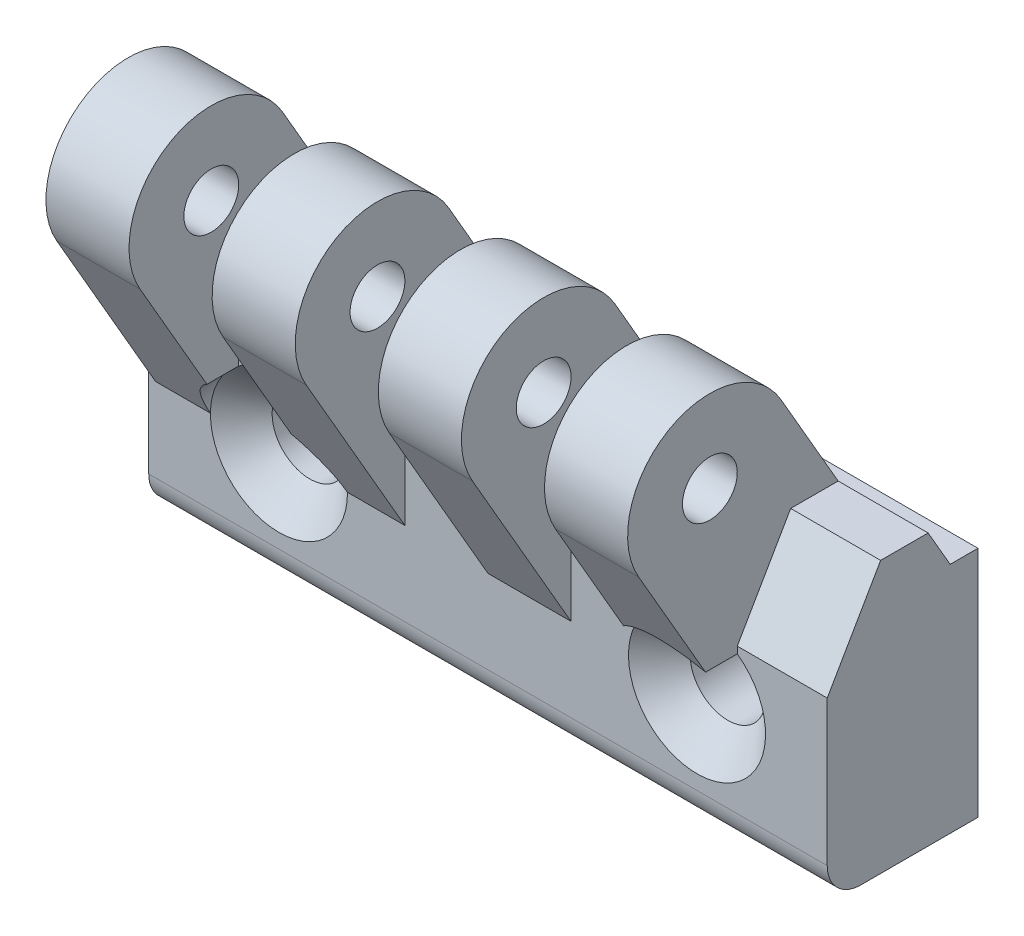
ISO-10303-21;
HEADER;
FILE_DESCRIPTION(('STEP AP214'),'2;1');
FILE_NAME('part.step','',(''),(''),'','','');
FILE_SCHEMA(('AUTOMOTIVE_DESIGN { 1 0 10303 214 1 1 1 1 }'));
ENDSEC;
DATA;
#1=APPLICATION_CONTEXT('core data for automotive mechanical design processes');
#2=APPLICATION_PROTOCOL_DEFINITION('international standard','automotive_design',2000,#1);
#3=PRODUCT_CONTEXT('',#1,'mechanical');
#4=PRODUCT('Part','Part','',(#3));
#5=PRODUCT_RELATED_PRODUCT_CATEGORY('part','',(#4));
#6=PRODUCT_DEFINITION_FORMATION('','',#4);
#7=PRODUCT_DEFINITION_CONTEXT('part definition',#1,'design');
#8=PRODUCT_DEFINITION('design','',#6,#7);
#9=PRODUCT_DEFINITION_SHAPE('','',#8);
#10=(LENGTH_UNIT() NAMED_UNIT(*) SI_UNIT(.MILLI.,.METRE.));
#11=(NAMED_UNIT(*) PLANE_ANGLE_UNIT() SI_UNIT($,.RADIAN.));
#12=(NAMED_UNIT(*) SI_UNIT($,.STERADIAN.) SOLID_ANGLE_UNIT());
#13=UNCERTAINTY_MEASURE_WITH_UNIT(LENGTH_MEASURE(1.E-05),#10,'distance_accuracy_value','');
#14=(GEOMETRIC_REPRESENTATION_CONTEXT(3) GLOBAL_UNCERTAINTY_ASSIGNED_CONTEXT((#13)) GLOBAL_UNIT_ASSIGNED_CONTEXT((#10,
#11,#12)) REPRESENTATION_CONTEXT('',''));
#15=CARTESIAN_POINT('',(0.,0.,0.));
#16=DIRECTION('',(0.,0.,1.));
#17=DIRECTION('',(1.,0.,0.));
#18=AXIS2_PLACEMENT_3D('',#15,#16,#17);
#19=CARTESIAN_POINT('',(40.,8.5000000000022,4.49293380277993E-13));
#20=DIRECTION('',(0.,0.,-1.));
#21=DIRECTION('',(0.,-1.,0.));
#22=AXIS2_PLACEMENT_3D('',#19,#20,#21);
#23=PLANE('',#22);
#24=CARTESIAN_POINT('',(30.5,0.,-2.2291196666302E-12));
#25=DIRECTION('',(0.,0.,1.));
#26=DIRECTION('',(-1.,0.,0.));
#27=AXIS2_PLACEMENT_3D('',#24,#25,#26);
#28=CIRCLE('',#27,2.75);
#29=CARTESIAN_POINT('',(27.75,0.,-2.2291196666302E-12));
#30=VERTEX_POINT('',#29);
#31=EDGE_CURVE('E702',#30,#30,#28,.T.);
#32=ORIENTED_EDGE('',*,*,#31,.T.);
#33=EDGE_LOOP('',(#32));
#34=FACE_BOUND('',#33,.T.);
#35=DIRECTION('',(0.,-1.,0.));
#36=VECTOR('',#35,1.);
#37=CARTESIAN_POINT('',(-9.5,8.5000000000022,4.49293380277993E-13));
#38=LINE('',#37,#36);
#39=CARTESIAN_POINT('',(-9.5,8.5000000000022,4.49293380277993E-13));
#40=VERTEX_POINT('',#39);
#41=CARTESIAN_POINT('',(-9.5,-8.4999999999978,-4.5102810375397E-13));
#42=VERTEX_POINT('',#41);
#43=EDGE_CURVE('E353',#40,#42,#38,.T.);
#44=ORIENTED_EDGE('',*,*,#43,.F.);
#45=DIRECTION('',(-1.,0.,0.));
#46=VECTOR('',#45,1.);
#47=CARTESIAN_POINT('',(40.,8.5000000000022,4.49293380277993E-13));
#48=LINE('',#47,#46);
#49=CARTESIAN_POINT('',(40.,8.5000000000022,4.49293380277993E-13));
#50=VERTEX_POINT('',#49);
#51=EDGE_CURVE('E402',#50,#40,#48,.T.);
#52=ORIENTED_EDGE('',*,*,#51,.F.);
#53=DIRECTION('',(0.,-1.,0.));
#54=VECTOR('',#53,1.);
#55=CARTESIAN_POINT('',(40.,8.5000000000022,4.49293380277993E-13));
#56=LINE('',#55,#54);
#57=CARTESIAN_POINT('',(40.,-8.4999999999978,-4.5102810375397E-13));
#58=VERTEX_POINT('',#57);
#59=EDGE_CURVE('E376',#50,#58,#56,.T.);
#60=ORIENTED_EDGE('',*,*,#59,.T.);
#61=DIRECTION('',(-1.,0.,0.));
#62=VECTOR('',#61,1.);
#63=CARTESIAN_POINT('',(40.,-8.4999999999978,-4.5102810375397E-13));
#64=LINE('',#63,#62);
#65=EDGE_CURVE('E400',#58,#42,#64,.T.);
#66=ORIENTED_EDGE('',*,*,#65,.T.);
#67=EDGE_LOOP('',(#44,#52,#60,#66));
#68=FACE_BOUND('',#67,.T.);
#69=CARTESIAN_POINT('',(0.,0.,-2.2291196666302E-12));
#70=DIRECTION('',(0.,0.,1.));
#71=DIRECTION('',(-1.,0.,0.));
#72=AXIS2_PLACEMENT_3D('',#69,#70,#71);
#73=CIRCLE('',#72,2.75);
#74=CARTESIAN_POINT('',(-2.75,0.,-2.2291196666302E-12));
#75=VERTEX_POINT('',#74);
#76=EDGE_CURVE('E1105',#75,#75,#73,.T.);
#77=ORIENTED_EDGE('',*,*,#76,.T.);
#78=EDGE_LOOP('',(#77));
#79=FACE_BOUND('',#78,.T.);
#80=ADVANCED_FACE('F16',(#34,#68,#79),#23,.T.);
#81=CARTESIAN_POINT('',(40.,-6.05555555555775,10.9999999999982));
#82=DIRECTION('',(0.,0.,1.));
#83=DIRECTION('',(0.,1.,0.));
#84=AXIS2_PLACEMENT_3D('',#81,#82,#83);
#85=PLANE('',#84);
#86=CARTESIAN_POINT('',(0.,0.,10.9999999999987));
#87=DIRECTION('',(0.,0.,1.));
#88=DIRECTION('',(-1.,0.,0.));
#89=AXIS2_PLACEMENT_3D('',#86,#87,#88);
#90=CIRCLE('',#89,5.);
#91=CARTESIAN_POINT('',(-2.1045108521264,4.5355301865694,10.9999999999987));
#92=VERTEX_POINT('',#91);
#93=CARTESIAN_POINT('',(-2.9375,4.04612082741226,10.999999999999));
#94=VERTEX_POINT('',#93);
#95=EDGE_CURVE('E259',#92,#94,#90,.T.);
#96=ORIENTED_EDGE('',*,*,#95,.F.);
#97=DIRECTION('',(-1.,0.,0.));
#98=VECTOR('',#97,1.);
#99=CARTESIAN_POINT('',(40.,4.53553018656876,10.9999999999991));
#100=LINE('',#99,#98);
#101=CARTESIAN_POINT('',(-2.9375,4.53553018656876,10.9999999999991));
#102=VERTEX_POINT('',#101);
#103=EDGE_CURVE('E394',#92,#102,#100,.T.);
#104=ORIENTED_EDGE('',*,*,#103,.T.);
#105=DIRECTION('',(0.,-1.,1.03320874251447E-13));
#106=VECTOR('',#105,1.);
#107=CARTESIAN_POINT('',(-2.9375,4.53553018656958,10.9999999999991));
#108=LINE('',#107,#106);
#109=EDGE_CURVE('E330',#102,#94,#108,.T.);
#110=ORIENTED_EDGE('',*,*,#109,.T.);
#111=EDGE_LOOP('',(#96,#104,#110));
#112=FACE_BOUND('',#111,.T.);
#113=ADVANCED_FACE('F539',(#112),#85,.T.);
#114=CARTESIAN_POINT('',(-4.99987112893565,0.0358983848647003,10.9999999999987));
#115=VERTEX_POINT('',#114);
#116=CARTESIAN_POINT('',(4.99987112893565,0.0358983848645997,10.9999999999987));
#117=VERTEX_POINT('',#116);
#118=EDGE_CURVE('E249',#115,#117,#90,.T.);
#119=ORIENTED_EDGE('',*,*,#118,.F.);
#120=DIRECTION('',(-1.,0.,0.));
#121=VECTOR('',#120,1.);
#122=CARTESIAN_POINT('',(-2.9375,0.0358983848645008,10.9999999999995));
#123=LINE('',#122,#121);
#124=CARTESIAN_POINT('',(-9.,0.0358983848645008,10.9999999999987));
#125=VERTEX_POINT('',#124);
#126=EDGE_CURVE('E339',#115,#125,#123,.T.);
#127=ORIENTED_EDGE('',*,*,#126,.T.);
#128=DIRECTION('',(0.,-1.,1.03320874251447E-13));
#129=VECTOR('',#128,1.);
#130=CARTESIAN_POINT('',(-9.,4.53553018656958,10.9999999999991));
#131=LINE('',#130,#129);
#132=CARTESIAN_POINT('',(-9.,4.53553018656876,10.9999999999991));
#133=VERTEX_POINT('',#132);
#134=EDGE_CURVE('E312',#133,#125,#131,.T.);
#135=ORIENTED_EDGE('',*,*,#134,.F.);
#136=CARTESIAN_POINT('',(-9.5,4.53553018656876,10.9999999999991));
#137=VERTEX_POINT('',#136);
#138=EDGE_CURVE('E395',#133,#137,#100,.T.);
#139=ORIENTED_EDGE('',*,*,#138,.T.);
#140=DIRECTION('',(0.,1.,0.));
#141=VECTOR('',#140,1.);
#142=CARTESIAN_POINT('',(-9.5,-6.05555555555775,10.9999999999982));
#143=LINE('',#142,#141);
#144=CARTESIAN_POINT('',(-9.5,-6.05555555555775,10.9999999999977));
#145=VERTEX_POINT('',#144);
#146=EDGE_CURVE('E362',#145,#137,#143,.T.);
#147=ORIENTED_EDGE('',*,*,#146,.F.);
#148=DIRECTION('',(-1.,0.,0.));
#149=VECTOR('',#148,1.);
#150=CARTESIAN_POINT('',(40.,-6.05555555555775,10.9999999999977));
#151=LINE('',#150,#149);
#152=CARTESIAN_POINT('',(40.,-6.05555555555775,10.9999999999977));
#153=VERTEX_POINT('',#152);
#154=EDGE_CURVE('E396',#153,#145,#151,.T.);
#155=ORIENTED_EDGE('',*,*,#154,.F.);
#156=DIRECTION('',(0.,1.,0.));
#157=VECTOR('',#156,1.);
#158=CARTESIAN_POINT('',(40.,-6.05555555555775,10.9999999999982));
#159=LINE('',#158,#157);
#160=CARTESIAN_POINT('',(40.,4.53553018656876,10.9999999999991));
#161=VERTEX_POINT('',#160);
#162=EDGE_CURVE('E386',#153,#161,#159,.T.);
#163=ORIENTED_EDGE('',*,*,#162,.T.);
#164=CARTESIAN_POINT('',(33.4375,4.53553018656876,10.9999999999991));
#165=VERTEX_POINT('',#164);
#166=EDGE_CURVE('E390',#161,#165,#100,.T.);
#167=ORIENTED_EDGE('',*,*,#166,.T.);
#168=DIRECTION('',(0.,-1.,1.03320874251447E-13));
#169=VECTOR('',#168,1.);
#170=CARTESIAN_POINT('',(33.4375,4.5355301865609,10.9999999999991));
#171=LINE('',#170,#169);
#172=CARTESIAN_POINT('',(33.4375,4.04612082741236,10.999999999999));
#173=VERTEX_POINT('',#172);
#174=EDGE_CURVE('E630',#165,#173,#171,.T.);
#175=ORIENTED_EDGE('',*,*,#174,.T.);
#176=CARTESIAN_POINT('',(30.5,0.,10.9999999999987));
#177=DIRECTION('',(0.,0.,1.));
#178=DIRECTION('',(-1.,0.,0.));
#179=AXIS2_PLACEMENT_3D('',#176,#177,#178);
#180=CIRCLE('',#179,5.);
#181=CARTESIAN_POINT('',(27.3750000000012,3.90312374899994,10.9999999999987));
#182=VERTEX_POINT('',#181);
#183=EDGE_CURVE('E710',#182,#173,#180,.T.);
#184=ORIENTED_EDGE('',*,*,#183,.F.);
#185=DIRECTION('',(0.,-1.,1.03320874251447E-13));
#186=VECTOR('',#185,1.);
#187=CARTESIAN_POINT('',(27.375,4.5355301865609,10.9999999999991));
#188=LINE('',#187,#186);
#189=CARTESIAN_POINT('',(27.375,4.53553018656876,10.9999999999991));
#190=VERTEX_POINT('',#189);
#191=EDGE_CURVE('E31',#190,#182,#188,.T.);
#192=ORIENTED_EDGE('',*,*,#191,.F.);
#193=CARTESIAN_POINT('',(21.3125,4.53553018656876,10.9999999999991));
#194=VERTEX_POINT('',#193);
#195=EDGE_CURVE('E393',#190,#194,#100,.T.);
#196=ORIENTED_EDGE('',*,*,#195,.T.);
#197=DIRECTION('',(0.,-1.,1.03320874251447E-13));
#198=VECTOR('',#197,1.);
#199=CARTESIAN_POINT('',(21.3125,4.53553018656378,10.9999999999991));
#200=LINE('',#199,#198);
#201=CARTESIAN_POINT('',(21.3125,0.0358983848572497,10.9999999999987));
#202=VERTEX_POINT('',#201);
#203=EDGE_CURVE('E490',#194,#202,#200,.T.);
#204=ORIENTED_EDGE('',*,*,#203,.T.);
#205=DIRECTION('',(-1.,0.,0.));
#206=VECTOR('',#205,1.);
#207=CARTESIAN_POINT('',(21.3125,0.0358983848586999,10.9999999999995));
#208=LINE('',#207,#206);
#209=CARTESIAN_POINT('',(15.25,0.0358983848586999,10.9999999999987));
#210=VERTEX_POINT('',#209);
#211=EDGE_CURVE('E515',#202,#210,#208,.T.);
#212=ORIENTED_EDGE('',*,*,#211,.T.);
#213=DIRECTION('',(0.,-1.,1.03320874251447E-13));
#214=VECTOR('',#213,1.);
#215=CARTESIAN_POINT('',(15.25,4.53553018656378,10.9999999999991));
#216=LINE('',#215,#214);
#217=CARTESIAN_POINT('',(15.25,4.53553018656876,10.9999999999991));
#218=VERTEX_POINT('',#217);
#219=EDGE_CURVE('E658',#218,#210,#216,.T.);
#220=ORIENTED_EDGE('',*,*,#219,.F.);
#221=CARTESIAN_POINT('',(9.1875,4.53553018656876,10.9999999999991));
#222=VERTEX_POINT('',#221);
#223=EDGE_CURVE('E486',#218,#222,#100,.T.);
#224=ORIENTED_EDGE('',*,*,#223,.T.);
#225=DIRECTION('',(0.,-1.,1.03320874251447E-13));
#226=VECTOR('',#225,1.);
#227=CARTESIAN_POINT('',(9.1875,4.53553018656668,10.9999999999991));
#228=LINE('',#227,#226);
#229=CARTESIAN_POINT('',(9.1875,0.0358983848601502,10.9999999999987));
#230=VERTEX_POINT('',#229);
#231=EDGE_CURVE('E285',#222,#230,#228,.T.);
#232=ORIENTED_EDGE('',*,*,#231,.T.);
#233=DIRECTION('',(-1.,0.,0.));
#234=VECTOR('',#233,1.);
#235=CARTESIAN_POINT('',(9.1875,0.0358983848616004,10.9999999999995));
#236=LINE('',#235,#234);
#237=EDGE_CURVE('E277',#230,#117,#236,.T.);
#238=ORIENTED_EDGE('',*,*,#237,.T.);
#239=EDGE_LOOP('',(#119,#127,#135,#139,#147,#155,#163,#167,#175,#184,#192,#196,#204,#212,#220,
#224,#232,#238));
#240=FACE_BOUND('',#239,.T.);
#241=ADVANCED_FACE('F283',(#240),#85,.T.);
#242=CARTESIAN_POINT('',(-2.9375,0.0358983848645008,10.9999999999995));
#243=DIRECTION('',(0.,-0.5,0.86602540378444));
#244=DIRECTION('',(0.,0.86602540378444,0.5));
#245=AXIS2_PLACEMENT_3D('',#242,#243,#244);
#246=PLANE('',#245);
#247=ORIENTED_EDGE('',*,*,#126,.F.);
#248=CARTESIAN_POINT('',(0.,2.19962936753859E-12,10.9792740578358));
#249=DIRECTION('',(0.,-0.5,0.86602540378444));
#250=DIRECTION('',(0.,-0.86602540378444,-0.5));
#251=AXIS2_PLACEMENT_3D('',#248,#249,#250);
#252=ELLIPSE('',#251,5.77350269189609,5.0000000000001);
#253=CARTESIAN_POINT('',(-2.9375,4.04612082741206,13.3153030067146));
#254=VERTEX_POINT('',#253);
#255=EDGE_CURVE('E270',#115,#254,#252,.F.);
#256=ORIENTED_EDGE('',*,*,#255,.T.);
#257=DIRECTION('',(0.,0.86602540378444,0.5));
#258=VECTOR('',#257,1.);
#259=CARTESIAN_POINT('',(-2.9375,0.0358983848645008,10.9999999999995));
#260=LINE('',#259,#258);
#261=CARTESIAN_POINT('',(-2.9375,12.5000000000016,18.1961524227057));
#262=VERTEX_POINT('',#261);
#263=EDGE_CURVE('E333',#254,#262,#260,.T.);
#264=ORIENTED_EDGE('',*,*,#263,.T.);
#265=DIRECTION('',(-1.,0.,0.));
#266=VECTOR('',#265,1.);
#267=CARTESIAN_POINT('',(-2.9375,12.5000000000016,18.1961524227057));
#268=LINE('',#267,#266);
#269=CARTESIAN_POINT('',(-9.,12.5000000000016,18.1961524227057));
#270=VERTEX_POINT('',#269);
#271=EDGE_CURVE('E336',#262,#270,#268,.T.);
#272=ORIENTED_EDGE('',*,*,#271,.T.);
#273=DIRECTION('',(0.,0.86602540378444,0.5));
#274=VECTOR('',#273,1.);
#275=CARTESIAN_POINT('',(-9.,0.0358983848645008,10.9999999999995));
#276=LINE('',#275,#274);
#277=EDGE_CURVE('E315',#125,#270,#276,.T.);
#278=ORIENTED_EDGE('',*,*,#277,.F.);
#279=EDGE_LOOP('',(#247,#256,#264,#272,#278));
#280=FACE_BOUND('',#279,.T.);
#281=ADVANCED_FACE('F694',(#280),#246,.T.);
#282=CARTESIAN_POINT('',(-2.9375,15.5000000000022,12.9999999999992));
#283=DIRECTION('',(-1.,0.,0.));
#284=DIRECTION('',(0.,-1.,0.));
#285=AXIS2_PLACEMENT_3D('',#282,#283,#284);
#286=PLANE('',#285);
#287=CARTESIAN_POINT('',(-2.9375,15.5000000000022,12.9999999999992));
#288=DIRECTION('',(-1.,0.,0.));
#289=DIRECTION('',(0.,-1.,0.));
#290=AXIS2_PLACEMENT_3D('',#287,#288,#289);
#291=CIRCLE('',#290,2.);
#292=CARTESIAN_POINT('',(-2.9375,13.5000000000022,12.9999999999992));
#293=VERTEX_POINT('',#292);
#294=EDGE_CURVE('E297',#293,#293,#291,.T.);
#295=ORIENTED_EDGE('',*,*,#294,.T.);
#296=EDGE_LOOP('',(#295));
#297=FACE_BOUND('',#296,.T.);
#298=DIRECTION('',(0.,0.,-1.));
#299=VECTOR('',#298,1.);
#300=CARTESIAN_POINT('',(-2.9375,4.0461208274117,17.0624999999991));
#301=LINE('',#300,#299);
#302=EDGE_CURVE('E10',#94,#254,#301,.F.);
#303=ORIENTED_EDGE('',*,*,#302,.F.);
#304=ORIENTED_EDGE('',*,*,#109,.F.);
#305=DIRECTION('',(0.,-0.866025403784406,0.500000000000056));
#306=VECTOR('',#305,1.);
#307=CARTESIAN_POINT('',(-2.9375,11.2857142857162,7.10277939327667));
#308=LINE('',#307,#306);
#309=CARTESIAN_POINT('',(-2.9375,11.2857142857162,7.10277939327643));
#310=VERTEX_POINT('',#309);
#311=EDGE_CURVE('E327',#310,#102,#308,.T.);
#312=ORIENTED_EDGE('',*,*,#311,.F.);
#313=DIRECTION('',(0.,0.,1.));
#314=VECTOR('',#313,1.);
#315=CARTESIAN_POINT('',(-2.9375,11.2857142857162,3.6386777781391));
#316=LINE('',#315,#314);
#317=CARTESIAN_POINT('',(-2.9375,11.2857142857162,3.63867777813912));
#318=VERTEX_POINT('',#317);
#319=EDGE_CURVE('E324',#318,#310,#316,.T.);
#320=ORIENTED_EDGE('',*,*,#319,.F.);
#321=DIRECTION('',(0.,-0.866025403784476,-0.499999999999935));
#322=VECTOR('',#321,1.);
#323=CARTESIAN_POINT('',(-2.9375,18.500000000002,7.8038475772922));
#324=LINE('',#323,#322);
#325=CARTESIAN_POINT('',(-2.9375,18.500000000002,7.8038475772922));
#326=VERTEX_POINT('',#325);
#327=EDGE_CURVE('E321',#326,#318,#324,.T.);
#328=ORIENTED_EDGE('',*,*,#327,.F.);
#329=CARTESIAN_POINT('',(-2.9375,15.5000000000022,12.9999999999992));
#330=DIRECTION('',(-1.,0.,0.));
#331=DIRECTION('',(0.,-1.,0.));
#332=AXIS2_PLACEMENT_3D('',#329,#330,#331);
#333=CIRCLE('',#332,6.00000000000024);
#334=EDGE_CURVE('E318',#262,#326,#333,.T.);
#335=ORIENTED_EDGE('',*,*,#334,.F.);
#336=ORIENTED_EDGE('',*,*,#263,.F.);
#337=EDGE_LOOP('',(#303,#304,#312,#320,#328,#335,#336));
#338=FACE_BOUND('',#337,.T.);
#339=ADVANCED_FACE('F534',(#297,#338),#286,.F.);
#340=CARTESIAN_POINT('',(9.1875,0.0358983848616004,10.9999999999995));
#341=DIRECTION('',(0.,-0.5,0.86602540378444));
#342=DIRECTION('',(0.,0.86602540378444,0.5));
#343=AXIS2_PLACEMENT_3D('',#340,#341,#342);
#344=PLANE('',#343);
#345=DIRECTION('',(0.,0.86602540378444,0.5));
#346=VECTOR('',#345,1.);
#347=CARTESIAN_POINT('',(3.125,0.0358983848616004,10.9999999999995));
#348=LINE('',#347,#346);
#349=CARTESIAN_POINT('',(3.125,3.9031237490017,13.2327436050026));
#350=VERTEX_POINT('',#349);
#351=CARTESIAN_POINT('',(3.125,12.4999999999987,18.1961524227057));
#352=VERTEX_POINT('',#351);
#353=EDGE_CURVE('E280',#350,#352,#348,.T.);
#354=ORIENTED_EDGE('',*,*,#353,.F.);
#355=CARTESIAN_POINT('',(0.,2.19962936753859E-12,10.9792740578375));
#356=DIRECTION('',(0.,-0.5,0.86602540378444));
#357=DIRECTION('',(0.,-0.86602540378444,-0.5));
#358=AXIS2_PLACEMENT_3D('',#355,#356,#357);
#359=ELLIPSE('',#358,5.77350269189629,5.00000000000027);
#360=EDGE_CURVE('E267',#350,#117,#359,.F.);
#361=ORIENTED_EDGE('',*,*,#360,.T.);
#362=ORIENTED_EDGE('',*,*,#237,.F.);
#363=DIRECTION('',(0.,0.86602540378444,0.5));
#364=VECTOR('',#363,1.);
#365=CARTESIAN_POINT('',(9.1875,0.0358983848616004,10.9999999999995));
#366=LINE('',#365,#364);
#367=CARTESIAN_POINT('',(9.1875,12.4999999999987,18.1961524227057));
#368=VERTEX_POINT('',#367);
#369=EDGE_CURVE('E291',#230,#368,#366,.T.);
#370=ORIENTED_EDGE('',*,*,#369,.T.);
#371=DIRECTION('',(-1.,0.,0.));
#372=VECTOR('',#371,1.);
#373=CARTESIAN_POINT('',(9.1875,12.4999999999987,18.1961524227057));
#374=LINE('',#373,#372);
#375=EDGE_CURVE('E286',#368,#352,#374,.T.);
#376=ORIENTED_EDGE('',*,*,#375,.T.);
#377=EDGE_LOOP('',(#354,#361,#362,#370,#376));
#378=FACE_BOUND('',#377,.T.);
#379=ADVANCED_FACE('F275',(#378),#344,.T.);
#380=CARTESIAN_POINT('',(3.125,15.4999999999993,12.9999999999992));
#381=DIRECTION('',(-1.,0.,0.));
#382=DIRECTION('',(0.,-1.,0.));
#383=AXIS2_PLACEMENT_3D('',#380,#381,#382);
#384=PLANE('',#383);
#385=CARTESIAN_POINT('',(3.125,15.4999999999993,12.9999999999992));
#386=DIRECTION('',(-1.,0.,0.));
#387=DIRECTION('',(0.,-1.,0.));
#388=AXIS2_PLACEMENT_3D('',#385,#386,#387);
#389=CIRCLE('',#388,2.);
#390=CARTESIAN_POINT('',(3.125,13.4999999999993,12.9999999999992));
#391=VERTEX_POINT('',#390);
#392=EDGE_CURVE('E459',#391,#391,#389,.T.);
#393=ORIENTED_EDGE('',*,*,#392,.F.);
#394=EDGE_LOOP('',(#393));
#395=FACE_BOUND('',#394,.T.);
#396=DIRECTION('',(0.,-1.,1.03320874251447E-13));
#397=VECTOR('',#396,1.);
#398=CARTESIAN_POINT('',(3.125,4.53553018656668,10.9999999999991));
#399=LINE('',#398,#397);
#400=CARTESIAN_POINT('',(3.125,4.53553018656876,10.9999999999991));
#401=VERTEX_POINT('',#400);
#402=CARTESIAN_POINT('',(3.12499999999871,3.90312374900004,10.9999999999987));
#403=VERTEX_POINT('',#402);
#404=EDGE_CURVE('E418',#401,#403,#399,.T.);
#405=ORIENTED_EDGE('',*,*,#404,.T.);
#406=DIRECTION('',(0.,0.,-1.));
#407=VECTOR('',#406,1.);
#408=CARTESIAN_POINT('',(3.125,3.90312374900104,17.0624999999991));
#409=LINE('',#408,#407);
#410=EDGE_CURVE('E24',#403,#350,#409,.F.);
#411=ORIENTED_EDGE('',*,*,#410,.T.);
#412=ORIENTED_EDGE('',*,*,#353,.T.);
#413=CARTESIAN_POINT('',(3.125,15.4999999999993,12.9999999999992));
#414=DIRECTION('',(-1.,0.,0.));
#415=DIRECTION('',(0.,-1.,0.));
#416=AXIS2_PLACEMENT_3D('',#413,#414,#415);
#417=CIRCLE('',#416,6.00000000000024);
#418=CARTESIAN_POINT('',(3.125,18.4999999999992,7.8038475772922));
#419=VERTEX_POINT('',#418);
#420=EDGE_CURVE('E452',#352,#419,#417,.T.);
#421=ORIENTED_EDGE('',*,*,#420,.T.);
#422=DIRECTION('',(0.,-0.866025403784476,-0.499999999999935));
#423=VECTOR('',#422,1.);
#424=CARTESIAN_POINT('',(3.125,18.4999999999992,7.8038475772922));
#425=LINE('',#424,#423);
#426=CARTESIAN_POINT('',(3.125,11.2857142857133,3.6386777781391));
#427=VERTEX_POINT('',#426);
#428=EDGE_CURVE('E454',#419,#427,#425,.T.);
#429=ORIENTED_EDGE('',*,*,#428,.T.);
#430=DIRECTION('',(0.,0.,1.));
#431=VECTOR('',#430,1.);
#432=CARTESIAN_POINT('',(3.125,11.2857142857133,3.6386777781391));
#433=LINE('',#432,#431);
#434=CARTESIAN_POINT('',(3.125,11.2857142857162,7.10277939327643));
#435=VERTEX_POINT('',#434);
#436=EDGE_CURVE('E427',#427,#435,#433,.T.);
#437=ORIENTED_EDGE('',*,*,#436,.T.);
#438=DIRECTION('',(0.,-0.866025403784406,0.500000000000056));
#439=VECTOR('',#438,1.);
#440=CARTESIAN_POINT('',(3.125,11.2857142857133,7.10277939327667));
#441=LINE('',#440,#439);
#442=EDGE_CURVE('E420',#435,#401,#441,.T.);
#443=ORIENTED_EDGE('',*,*,#442,.T.);
#444=EDGE_LOOP('',(#405,#411,#412,#421,#429,#437,#443));
#445=FACE_BOUND('',#444,.T.);
#446=ADVANCED_FACE('F415',(#395,#445),#384,.T.);
#447=CARTESIAN_POINT('',(33.4375,0.0358983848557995,10.9999999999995));
#448=DIRECTION('',(0.,-0.5,0.86602540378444));
#449=DIRECTION('',(0.,0.86602540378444,0.5));
#450=AXIS2_PLACEMENT_3D('',#447,#448,#449);
#451=PLANE('',#450);
#452=DIRECTION('',(0.,0.86602540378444,0.5));
#453=VECTOR('',#452,1.);
#454=CARTESIAN_POINT('',(27.375,0.0358983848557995,10.9999999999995));
#455=LINE('',#454,#453);
#456=CARTESIAN_POINT('',(27.375,3.9031237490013,13.2327436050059));
#457=VERTEX_POINT('',#456);
#458=CARTESIAN_POINT('',(27.375,12.4999999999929,18.1961524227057));
#459=VERTEX_POINT('',#458);
#460=EDGE_CURVE('E619',#457,#459,#455,.T.);
#461=ORIENTED_EDGE('',*,*,#460,.F.);
#462=CARTESIAN_POINT('',(30.5,2.19962936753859E-12,10.9792740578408));
#463=DIRECTION('',(0.,-0.5,0.86602540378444));
#464=DIRECTION('',(0.,-0.86602540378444,-0.5));
#465=AXIS2_PLACEMENT_3D('',#462,#463,#464);
#466=ELLIPSE('',#465,5.77350269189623,5.00000000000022);
#467=CARTESIAN_POINT('',(33.4375,4.04612082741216,13.3153030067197));
#468=VERTEX_POINT('',#467);
#469=EDGE_CURVE('E715',#457,#468,#466,.F.);
#470=ORIENTED_EDGE('',*,*,#469,.T.);
#471=DIRECTION('',(0.,0.86602540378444,0.5));
#472=VECTOR('',#471,1.);
#473=CARTESIAN_POINT('',(33.4375,0.0358983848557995,10.9999999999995));
#474=LINE('',#473,#472);
#475=CARTESIAN_POINT('',(33.4375,12.4999999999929,18.1961524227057));
#476=VERTEX_POINT('',#475);
#477=EDGE_CURVE('E633',#468,#476,#474,.T.);
#478=ORIENTED_EDGE('',*,*,#477,.T.);
#479=DIRECTION('',(-1.,0.,0.));
#480=VECTOR('',#479,1.);
#481=CARTESIAN_POINT('',(33.4375,12.4999999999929,18.1961524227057));
#482=LINE('',#481,#480);
#483=EDGE_CURVE('E636',#476,#459,#482,.T.);
#484=ORIENTED_EDGE('',*,*,#483,.T.);
#485=EDGE_LOOP('',(#461,#470,#478,#484));
#486=FACE_BOUND('',#485,.T.);
#487=ADVANCED_FACE('F523',(#486),#451,.T.);
#488=CARTESIAN_POINT('',(33.4375,15.4999999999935,12.9999999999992));
#489=DIRECTION('',(-1.,0.,0.));
#490=DIRECTION('',(0.,-1.,0.));
#491=AXIS2_PLACEMENT_3D('',#488,#489,#490);
#492=PLANE('',#491);
#493=CARTESIAN_POINT('',(33.4375,15.4999999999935,12.9999999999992));
#494=DIRECTION('',(-1.,0.,0.));
#495=DIRECTION('',(0.,-1.,0.));
#496=AXIS2_PLACEMENT_3D('',#493,#494,#495);
#497=CIRCLE('',#496,2.);
#498=CARTESIAN_POINT('',(33.4375,13.4999999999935,12.9999999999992));
#499=VERTEX_POINT('',#498);
#500=EDGE_CURVE('E613',#499,#499,#497,.T.);
#501=ORIENTED_EDGE('',*,*,#500,.T.);
#502=EDGE_LOOP('',(#501));
#503=FACE_BOUND('',#502,.T.);
#504=DIRECTION('',(0.,0.,-1.));
#505=VECTOR('',#504,1.);
#506=CARTESIAN_POINT('',(33.4375,4.04612082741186,17.0624999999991));
#507=LINE('',#506,#505);
#508=EDGE_CURVE('E718',#173,#468,#507,.F.);
#509=ORIENTED_EDGE('',*,*,#508,.F.);
#510=ORIENTED_EDGE('',*,*,#174,.F.);
#511=DIRECTION('',(0.,-0.866025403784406,0.500000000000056));
#512=VECTOR('',#511,1.);
#513=CARTESIAN_POINT('',(33.4375,11.2857142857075,7.10277939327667));
#514=LINE('',#513,#512);
#515=CARTESIAN_POINT('',(33.4375,11.2857142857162,7.10277939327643));
#516=VERTEX_POINT('',#515);
#517=EDGE_CURVE('E39',#516,#165,#514,.T.);
#518=ORIENTED_EDGE('',*,*,#517,.F.);
#519=DIRECTION('',(0.,0.,1.));
#520=VECTOR('',#519,1.);
#521=CARTESIAN_POINT('',(33.4375,11.2857142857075,3.6386777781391));
#522=LINE('',#521,#520);
#523=CARTESIAN_POINT('',(33.4375,11.2857142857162,3.63867777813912));
#524=VERTEX_POINT('',#523);
#525=EDGE_CURVE('E627',#524,#516,#522,.T.);
#526=ORIENTED_EDGE('',*,*,#525,.F.);
#527=DIRECTION('',(0.,-0.866025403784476,-0.499999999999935));
#528=VECTOR('',#527,1.);
#529=CARTESIAN_POINT('',(33.4375,18.4999999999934,7.8038475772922));
#530=LINE('',#529,#528);
#531=CARTESIAN_POINT('',(33.4375,18.4999999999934,7.8038475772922));
#532=VERTEX_POINT('',#531);
#533=EDGE_CURVE('E624',#532,#524,#530,.T.);
#534=ORIENTED_EDGE('',*,*,#533,.F.);
#535=CARTESIAN_POINT('',(33.4375,15.4999999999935,12.9999999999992));
#536=DIRECTION('',(-1.,0.,0.));
#537=DIRECTION('',(0.,-1.,0.));
#538=AXIS2_PLACEMENT_3D('',#535,#536,#537);
#539=CIRCLE('',#538,6.00000000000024);
#540=EDGE_CURVE('E621',#476,#532,#539,.T.);
#541=ORIENTED_EDGE('',*,*,#540,.F.);
#542=ORIENTED_EDGE('',*,*,#477,.F.);
#543=EDGE_LOOP('',(#509,#510,#518,#526,#534,#541,#542));
#544=FACE_BOUND('',#543,.T.);
#545=ADVANCED_FACE('F531',(#503,#544),#492,.F.);
#546=CARTESIAN_POINT('',(27.375,15.4999999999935,12.9999999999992));
#547=DIRECTION('',(-1.,0.,0.));
#548=DIRECTION('',(0.,-1.,0.));
#549=AXIS2_PLACEMENT_3D('',#546,#547,#548);
#550=PLANE('',#549);
#551=CARTESIAN_POINT('',(27.375,15.4999999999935,12.9999999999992));
#552=DIRECTION('',(-1.,0.,0.));
#553=DIRECTION('',(0.,-1.,0.));
#554=AXIS2_PLACEMENT_3D('',#551,#552,#553);
#555=CIRCLE('',#554,2.);
#556=CARTESIAN_POINT('',(27.375,13.4999999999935,12.9999999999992));
#557=VERTEX_POINT('',#556);
#558=EDGE_CURVE('E720',#557,#557,#555,.T.);
#559=ORIENTED_EDGE('',*,*,#558,.F.);
#560=EDGE_LOOP('',(#559));
#561=FACE_BOUND('',#560,.T.);
#562=ORIENTED_EDGE('',*,*,#191,.T.);
#563=DIRECTION('',(0.,0.,-1.));
#564=VECTOR('',#563,1.);
#565=CARTESIAN_POINT('',(27.375,3.90312374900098,17.0624999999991));
#566=LINE('',#565,#564);
#567=EDGE_CURVE('E392',#182,#457,#566,.F.);
#568=ORIENTED_EDGE('',*,*,#567,.T.);
#569=ORIENTED_EDGE('',*,*,#460,.T.);
#570=CARTESIAN_POINT('',(27.375,15.4999999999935,12.9999999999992));
#571=DIRECTION('',(-1.,0.,0.));
#572=DIRECTION('',(0.,-1.,0.));
#573=AXIS2_PLACEMENT_3D('',#570,#571,#572);
#574=CIRCLE('',#573,6.00000000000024);
#575=CARTESIAN_POINT('',(27.375,18.4999999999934,7.8038475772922));
#576=VERTEX_POINT('',#575);
#577=EDGE_CURVE('E611',#459,#576,#574,.T.);
#578=ORIENTED_EDGE('',*,*,#577,.T.);
#579=DIRECTION('',(0.,-0.866025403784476,-0.499999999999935));
#580=VECTOR('',#579,1.);
#581=CARTESIAN_POINT('',(27.375,18.4999999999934,7.8038475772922));
#582=LINE('',#581,#580);
#583=CARTESIAN_POINT('',(27.375,11.2857142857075,3.6386777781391));
#584=VERTEX_POINT('',#583);
#585=EDGE_CURVE('E605',#576,#584,#582,.T.);
#586=ORIENTED_EDGE('',*,*,#585,.T.);
#587=DIRECTION('',(0.,0.,1.));
#588=VECTOR('',#587,1.);
#589=CARTESIAN_POINT('',(27.375,11.2857142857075,3.6386777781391));
#590=LINE('',#589,#588);
#591=CARTESIAN_POINT('',(27.375,11.2857142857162,7.10277939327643));
#592=VERTEX_POINT('',#591);
#593=EDGE_CURVE('E601',#584,#592,#590,.T.);
#594=ORIENTED_EDGE('',*,*,#593,.T.);
#595=DIRECTION('',(0.,-0.866025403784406,0.500000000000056));
#596=VECTOR('',#595,1.);
#597=CARTESIAN_POINT('',(27.375,11.2857142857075,7.10277939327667));
#598=LINE('',#597,#596);
#599=EDGE_CURVE('E604',#592,#190,#598,.T.);
#600=ORIENTED_EDGE('',*,*,#599,.T.);
#601=EDGE_LOOP('',(#562,#568,#569,#578,#586,#594,#600));
#602=FACE_BOUND('',#601,.T.);
#603=ADVANCED_FACE('F609',(#561,#602),#550,.T.);
#604=CARTESIAN_POINT('',(40.,4.53553018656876,10.9999999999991));
#605=DIRECTION('',(0.,0.500000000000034,0.866025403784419));
#606=DIRECTION('',(0.,0.866025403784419,-0.500000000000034));
#607=AXIS2_PLACEMENT_3D('',#604,#605,#606);
#608=PLANE('',#607);
#609=DIRECTION('',(-1.,0.,0.));
#610=VECTOR('',#609,1.);
#611=CARTESIAN_POINT('',(40.,11.2857142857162,7.10277939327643));
#612=LINE('',#611,#610);
#613=CARTESIAN_POINT('',(40.,11.2857142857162,7.10277939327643));
#614=VERTEX_POINT('',#613);
#615=EDGE_CURVE('E410',#614,#516,#612,.T.);
#616=ORIENTED_EDGE('',*,*,#615,.T.);
#617=ORIENTED_EDGE('',*,*,#517,.T.);
#618=ORIENTED_EDGE('',*,*,#166,.F.);
#619=DIRECTION('',(0.,0.866025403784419,-0.500000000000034));
#620=VECTOR('',#619,1.);
#621=CARTESIAN_POINT('',(40.,4.53553018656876,10.9999999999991));
#622=LINE('',#621,#620);
#623=EDGE_CURVE('E365',#161,#614,#622,.T.);
#624=ORIENTED_EDGE('',*,*,#623,.T.);
#625=EDGE_LOOP('',(#616,#617,#618,#624));
#626=FACE_BOUND('',#625,.T.);
#627=ADVANCED_FACE('F583',(#626),#608,.T.);
#628=CARTESIAN_POINT('',(2.1045108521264,4.5355301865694,10.9999999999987));
#629=VERTEX_POINT('',#628);
#630=EDGE_CURVE('E262',#403,#629,#90,.T.);
#631=ORIENTED_EDGE('',*,*,#630,.F.);
#632=ORIENTED_EDGE('',*,*,#404,.F.);
#633=EDGE_CURVE('E485',#401,#629,#100,.T.);
#634=ORIENTED_EDGE('',*,*,#633,.T.);
#635=EDGE_LOOP('',(#631,#632,#634));
#636=FACE_BOUND('',#635,.T.);
#637=ADVANCED_FACE('F548',(#636),#85,.T.);
#638=CARTESIAN_POINT('',(40.,11.2857142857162,7.10277939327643));
#639=DIRECTION('',(0.,1.,0.));
#640=DIRECTION('',(0.,0.,-1.));
#641=AXIS2_PLACEMENT_3D('',#638,#639,#640);
#642=PLANE('',#641);
#643=DIRECTION('',(-1.,0.,0.));
#644=VECTOR('',#643,1.);
#645=CARTESIAN_POINT('',(40.,11.2857142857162,3.63867777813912));
#646=LINE('',#645,#644);
#647=CARTESIAN_POINT('',(40.,11.2857142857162,3.63867777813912));
#648=VERTEX_POINT('',#647);
#649=EDGE_CURVE('E406',#648,#524,#646,.T.);
#650=ORIENTED_EDGE('',*,*,#649,.T.);
#651=ORIENTED_EDGE('',*,*,#525,.T.);
#652=ORIENTED_EDGE('',*,*,#615,.F.);
#653=DIRECTION('',(0.,0.,-1.));
#654=VECTOR('',#653,1.);
#655=CARTESIAN_POINT('',(40.,11.2857142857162,7.10277939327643));
#656=LINE('',#655,#654);
#657=EDGE_CURVE('E368',#614,#648,#656,.T.);
#658=ORIENTED_EDGE('',*,*,#657,.T.);
#659=EDGE_LOOP('',(#650,#651,#652,#658));
#660=FACE_BOUND('',#659,.T.);
#661=ADVANCED_FACE('F564',(#660),#642,.T.);
#662=ORIENTED_EDGE('',*,*,#599,.F.);
#663=CARTESIAN_POINT('',(21.3125,11.2857142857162,7.10277939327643));
#664=VERTEX_POINT('',#663);
#665=EDGE_CURVE('E412',#592,#664,#612,.T.);
#666=ORIENTED_EDGE('',*,*,#665,.T.);
#667=DIRECTION('',(0.,-0.866025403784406,0.500000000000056));
#668=VECTOR('',#667,1.);
#669=CARTESIAN_POINT('',(21.3125,11.2857142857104,7.10277939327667));
#670=LINE('',#669,#668);
#671=EDGE_CURVE('E495',#664,#194,#670,.T.);
#672=ORIENTED_EDGE('',*,*,#671,.T.);
#673=ORIENTED_EDGE('',*,*,#195,.F.);
#674=EDGE_LOOP('',(#662,#666,#672,#673));
#675=FACE_BOUND('',#674,.T.);
#676=ADVANCED_FACE('F496',(#675),#608,.T.);
#677=ORIENTED_EDGE('',*,*,#593,.F.);
#678=CARTESIAN_POINT('',(21.3125,11.2857142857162,3.63867777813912));
#679=VERTEX_POINT('',#678);
#680=EDGE_CURVE('E408',#584,#679,#646,.T.);
#681=ORIENTED_EDGE('',*,*,#680,.T.);
#682=DIRECTION('',(0.,0.,1.));
#683=VECTOR('',#682,1.);
#684=CARTESIAN_POINT('',(21.3125,11.2857142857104,3.6386777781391));
#685=LINE('',#684,#683);
#686=EDGE_CURVE('E501',#679,#664,#685,.T.);
#687=ORIENTED_EDGE('',*,*,#686,.T.);
#688=ORIENTED_EDGE('',*,*,#665,.F.);
#689=EDGE_LOOP('',(#677,#681,#687,#688));
#690=FACE_BOUND('',#689,.T.);
#691=ADVANCED_FACE('F573',(#690),#642,.T.);
#692=DIRECTION('',(0.,-0.866025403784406,0.500000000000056));
#693=VECTOR('',#692,1.);
#694=CARTESIAN_POINT('',(15.25,11.2857142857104,7.10277939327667));
#695=LINE('',#694,#693);
#696=CARTESIAN_POINT('',(15.25,11.2857142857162,7.10277939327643));
#697=VERTEX_POINT('',#696);
#698=EDGE_CURVE('E655',#697,#218,#695,.T.);
#699=ORIENTED_EDGE('',*,*,#698,.F.);
#700=CARTESIAN_POINT('',(9.1875,11.2857142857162,7.10277939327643));
#701=VERTEX_POINT('',#700);
#702=EDGE_CURVE('E471',#697,#701,#612,.T.);
#703=ORIENTED_EDGE('',*,*,#702,.T.);
#704=DIRECTION('',(0.,-0.866025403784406,0.500000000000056));
#705=VECTOR('',#704,1.);
#706=CARTESIAN_POINT('',(9.1875,11.2857142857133,7.10277939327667));
#707=LINE('',#706,#705);
#708=EDGE_CURVE('E439',#701,#222,#707,.T.);
#709=ORIENTED_EDGE('',*,*,#708,.T.);
#710=ORIENTED_EDGE('',*,*,#223,.F.);
#711=EDGE_LOOP('',(#699,#703,#709,#710));
#712=FACE_BOUND('',#711,.T.);
#713=ADVANCED_FACE('F584',(#712),#608,.T.);
#714=DIRECTION('',(0.,0.,1.));
#715=VECTOR('',#714,1.);
#716=CARTESIAN_POINT('',(15.25,11.2857142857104,3.6386777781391));
#717=LINE('',#716,#715);
#718=CARTESIAN_POINT('',(15.25,11.2857142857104,3.6386777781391));
#719=VERTEX_POINT('',#718);
#720=EDGE_CURVE('E652',#719,#697,#717,.T.);
#721=ORIENTED_EDGE('',*,*,#720,.F.);
#722=CARTESIAN_POINT('',(9.1875,11.2857142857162,3.63867777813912));
#723=VERTEX_POINT('',#722);
#724=EDGE_CURVE('E680',#719,#723,#646,.T.);
#725=ORIENTED_EDGE('',*,*,#724,.T.);
#726=DIRECTION('',(0.,0.,1.));
#727=VECTOR('',#726,1.);
#728=CARTESIAN_POINT('',(9.1875,11.2857142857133,3.6386777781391));
#729=LINE('',#728,#727);
#730=EDGE_CURVE('E436',#723,#701,#729,.T.);
#731=ORIENTED_EDGE('',*,*,#730,.T.);
#732=ORIENTED_EDGE('',*,*,#702,.F.);
#733=EDGE_LOOP('',(#721,#725,#731,#732));
#734=FACE_BOUND('',#733,.T.);
#735=ADVANCED_FACE('F576',(#734),#642,.T.);
#736=CARTESIAN_POINT('',(0.,-6.5978921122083,17.4278843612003));
#737=DIRECTION('',(0.,0.500000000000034,0.866025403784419));
#738=DIRECTION('',(0.,-0.866025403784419,0.500000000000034));
#739=AXIS2_PLACEMENT_3D('',#736,#737,#738);
#740=ELLIPSE('',#739,13.1957842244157,9.33082850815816);
#741=EDGE_CURVE('E701',#629,#92,#740,.T.);
#742=ORIENTED_EDGE('',*,*,#741,.F.);
#743=ORIENTED_EDGE('',*,*,#633,.F.);
#744=ORIENTED_EDGE('',*,*,#442,.F.);
#745=EDGE_CURVE('E468',#435,#310,#612,.T.);
#746=ORIENTED_EDGE('',*,*,#745,.T.);
#747=ORIENTED_EDGE('',*,*,#311,.T.);
#748=ORIENTED_EDGE('',*,*,#103,.F.);
#749=EDGE_LOOP('',(#742,#743,#744,#746,#747,#748));
#750=FACE_BOUND('',#749,.T.);
#751=ADVANCED_FACE('F575',(#750),#608,.T.);
#752=ORIENTED_EDGE('',*,*,#436,.F.);
#753=EDGE_CURVE('E466',#427,#318,#646,.T.);
#754=ORIENTED_EDGE('',*,*,#753,.T.);
#755=ORIENTED_EDGE('',*,*,#319,.T.);
#756=ORIENTED_EDGE('',*,*,#745,.F.);
#757=EDGE_LOOP('',(#752,#754,#755,#756));
#758=FACE_BOUND('',#757,.T.);
#759=ADVANCED_FACE('F465',(#758),#642,.T.);
#760=DIRECTION('',(0.,-0.866025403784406,0.500000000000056));
#761=VECTOR('',#760,1.);
#762=CARTESIAN_POINT('',(-9.,11.2857142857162,7.10277939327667));
#763=LINE('',#762,#761);
#764=CARTESIAN_POINT('',(-9.,11.2857142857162,7.10277939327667));
#765=VERTEX_POINT('',#764);
#766=EDGE_CURVE('E309',#765,#133,#763,.T.);
#767=ORIENTED_EDGE('',*,*,#766,.F.);
#768=CARTESIAN_POINT('',(-9.5,11.2857142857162,7.10277939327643));
#769=VERTEX_POINT('',#768);
#770=EDGE_CURVE('E389',#765,#769,#612,.T.);
#771=ORIENTED_EDGE('',*,*,#770,.T.);
#772=DIRECTION('',(0.,0.866025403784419,-0.500000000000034));
#773=VECTOR('',#772,1.);
#774=CARTESIAN_POINT('',(-9.5,4.53553018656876,10.9999999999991));
#775=LINE('',#774,#773);
#776=EDGE_CURVE('E338',#137,#769,#775,.T.);
#777=ORIENTED_EDGE('',*,*,#776,.F.);
#778=ORIENTED_EDGE('',*,*,#138,.F.);
#779=EDGE_LOOP('',(#767,#771,#777,#778));
#780=FACE_BOUND('',#779,.T.);
#781=ADVANCED_FACE('F18',(#780),#608,.T.);
#782=CARTESIAN_POINT('',(40.,-6.0555555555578,8.55555555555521));
#783=DIRECTION('',(-1.,0.,0.));
#784=DIRECTION('',(0.,-1.,0.));
#785=AXIS2_PLACEMENT_3D('',#782,#783,#784);
#786=CYLINDRICAL_SURFACE('',#785,2.4444444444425);
#787=CARTESIAN_POINT('',(-9.5,-6.0555555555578,8.55555555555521));
#788=DIRECTION('',(-1.,0.,0.));
#789=DIRECTION('',(0.,-1.,0.));
#790=AXIS2_PLACEMENT_3D('',#787,#788,#789);
#791=CIRCLE('',#790,2.4444444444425);
#792=CARTESIAN_POINT('',(-9.5,-8.4999999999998,8.55555555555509));
#793=VERTEX_POINT('',#792);
#794=EDGE_CURVE('E359',#793,#145,#791,.T.);
#795=ORIENTED_EDGE('',*,*,#794,.F.);
#796=DIRECTION('',(-1.,0.,0.));
#797=VECTOR('',#796,1.);
#798=CARTESIAN_POINT('',(40.,-8.4999999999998,8.55555555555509));
#799=LINE('',#798,#797);
#800=CARTESIAN_POINT('',(40.,-8.4999999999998,8.55555555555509));
#801=VERTEX_POINT('',#800);
#802=EDGE_CURVE('E398',#801,#793,#799,.T.);
#803=ORIENTED_EDGE('',*,*,#802,.F.);
#804=CARTESIAN_POINT('',(40.,-6.0555555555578,8.55555555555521));
#805=DIRECTION('',(-1.,0.,0.));
#806=DIRECTION('',(0.,-1.,0.));
#807=AXIS2_PLACEMENT_3D('',#804,#805,#806);
#808=CIRCLE('',#807,2.4444444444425);
#809=EDGE_CURVE('E383',#801,#153,#808,.T.);
#810=ORIENTED_EDGE('',*,*,#809,.T.);
#811=ORIENTED_EDGE('',*,*,#154,.T.);
#812=EDGE_LOOP('',(#795,#803,#810,#811));
#813=FACE_BOUND('',#812,.T.);
#814=ADVANCED_FACE('F582',(#813),#786,.T.);
#815=CARTESIAN_POINT('',(40.,-8.4999999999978,-4.5102810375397E-13));
#816=DIRECTION('',(0.,-1.,-2.33579389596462E-13));
#817=DIRECTION('',(0.,-2.33579389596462E-13,1.));
#818=AXIS2_PLACEMENT_3D('',#815,#816,#817);
#819=PLANE('',#818);
#820=DIRECTION('',(0.,-2.33579389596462E-13,1.));
#821=VECTOR('',#820,1.);
#822=CARTESIAN_POINT('',(-9.5,-8.4999999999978,-4.5102810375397E-13));
#823=LINE('',#822,#821);
#824=EDGE_CURVE('E356',#42,#793,#823,.T.);
#825=ORIENTED_EDGE('',*,*,#824,.F.);
#826=ORIENTED_EDGE('',*,*,#65,.F.);
#827=DIRECTION('',(0.,-2.33579389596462E-13,1.));
#828=VECTOR('',#827,1.);
#829=CARTESIAN_POINT('',(40.,-8.4999999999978,-4.5102810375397E-13));
#830=LINE('',#829,#828);
#831=EDGE_CURVE('E380',#58,#801,#830,.T.);
#832=ORIENTED_EDGE('',*,*,#831,.T.);
#833=ORIENTED_EDGE('',*,*,#802,.T.);
#834=EDGE_LOOP('',(#825,#826,#832,#833));
#835=FACE_BOUND('',#834,.T.);
#836=ADVANCED_FACE('F553',(#835),#819,.T.);
#837=CARTESIAN_POINT('',(40.,8.5000000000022,2.03034488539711));
#838=DIRECTION('',(0.,1.,0.));
#839=DIRECTION('',(-1.,0.,0.));
#840=AXIS2_PLACEMENT_3D('',#837,#838,#839);
#841=PLANE('',#840);
#842=DIRECTION('',(0.,0.,-1.));
#843=VECTOR('',#842,1.);
#844=CARTESIAN_POINT('',(-9.5,8.5000000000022,2.03034488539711));
#845=LINE('',#844,#843);
#846=CARTESIAN_POINT('',(-9.5,8.5000000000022,2.03034488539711));
#847=VERTEX_POINT('',#846);
#848=EDGE_CURVE('E350',#847,#40,#845,.T.);
#849=ORIENTED_EDGE('',*,*,#848,.F.);
#850=DIRECTION('',(-1.,0.,0.));
#851=VECTOR('',#850,1.);
#852=CARTESIAN_POINT('',(40.,8.5000000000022,2.03034488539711));
#853=LINE('',#852,#851);
#854=CARTESIAN_POINT('',(40.,8.5000000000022,2.03034488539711));
#855=VERTEX_POINT('',#854);
#856=EDGE_CURVE('E404',#855,#847,#853,.T.);
#857=ORIENTED_EDGE('',*,*,#856,.F.);
#858=DIRECTION('',(0.,0.,-1.));
#859=VECTOR('',#858,1.);
#860=CARTESIAN_POINT('',(40.,8.5000000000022,2.03034488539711));
#861=LINE('',#860,#859);
#862=EDGE_CURVE('E374',#855,#50,#861,.T.);
#863=ORIENTED_EDGE('',*,*,#862,.T.);
#864=ORIENTED_EDGE('',*,*,#51,.T.);
#865=EDGE_LOOP('',(#849,#857,#863,#864));
#866=FACE_BOUND('',#865,.T.);
#867=ADVANCED_FACE('F555',(#866),#841,.T.);
#868=CARTESIAN_POINT('',(40.,11.2857142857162,3.63867777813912));
#869=DIRECTION('',(0.,0.49999999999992,-0.866025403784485));
#870=DIRECTION('',(0.,-0.866025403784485,-0.49999999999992));
#871=AXIS2_PLACEMENT_3D('',#868,#869,#870);
#872=PLANE('',#871);
#873=DIRECTION('',(0.,-0.866025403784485,-0.49999999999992));
#874=VECTOR('',#873,1.);
#875=CARTESIAN_POINT('',(-9.5,11.2857142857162,3.63867777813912));
#876=LINE('',#875,#874);
#877=CARTESIAN_POINT('',(-9.5,11.2857142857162,3.63867777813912));
#878=VERTEX_POINT('',#877);
#879=EDGE_CURVE('E347',#878,#847,#876,.T.);
#880=ORIENTED_EDGE('',*,*,#879,.F.);
#881=CARTESIAN_POINT('',(-9.,11.2857142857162,3.63867777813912));
#882=VERTEX_POINT('',#881);
#883=EDGE_CURVE('E409',#882,#878,#646,.T.);
#884=ORIENTED_EDGE('',*,*,#883,.F.);
#885=DIRECTION('',(0.,-0.866025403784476,-0.499999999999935));
#886=VECTOR('',#885,1.);
#887=CARTESIAN_POINT('',(-9.,18.500000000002,7.8038475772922));
#888=LINE('',#887,#886);
#889=CARTESIAN_POINT('',(-9.,18.500000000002,7.8038475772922));
#890=VERTEX_POINT('',#889);
#891=EDGE_CURVE('E303',#890,#882,#888,.T.);
#892=ORIENTED_EDGE('',*,*,#891,.F.);
#893=DIRECTION('',(-1.,0.,0.));
#894=VECTOR('',#893,1.);
#895=CARTESIAN_POINT('',(-2.9375,18.500000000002,7.8038475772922));
#896=LINE('',#895,#894);
#897=EDGE_CURVE('E335',#326,#890,#896,.T.);
#898=ORIENTED_EDGE('',*,*,#897,.F.);
#899=ORIENTED_EDGE('',*,*,#327,.T.);
#900=ORIENTED_EDGE('',*,*,#753,.F.);
#901=ORIENTED_EDGE('',*,*,#428,.F.);
#902=DIRECTION('',(-1.,0.,0.));
#903=VECTOR('',#902,1.);
#904=CARTESIAN_POINT('',(9.1875,18.4999999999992,7.8038475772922));
#905=LINE('',#904,#903);
#906=CARTESIAN_POINT('',(9.1875,18.4999999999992,7.8038475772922));
#907=VERTEX_POINT('',#906);
#908=EDGE_CURVE('E287',#907,#419,#905,.T.);
#909=ORIENTED_EDGE('',*,*,#908,.F.);
#910=DIRECTION('',(0.,-0.866025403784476,-0.499999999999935));
#911=VECTOR('',#910,1.);
#912=CARTESIAN_POINT('',(9.1875,18.4999999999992,7.8038475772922));
#913=LINE('',#912,#911);
#914=EDGE_CURVE('E433',#907,#723,#913,.T.);
#915=ORIENTED_EDGE('',*,*,#914,.T.);
#916=ORIENTED_EDGE('',*,*,#724,.F.);
#917=DIRECTION('',(0.,-0.866025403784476,-0.499999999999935));
#918=VECTOR('',#917,1.);
#919=CARTESIAN_POINT('',(15.25,18.4999999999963,7.8038475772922));
#920=LINE('',#919,#918);
#921=CARTESIAN_POINT('',(15.25,18.4999999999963,7.8038475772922));
#922=VERTEX_POINT('',#921);
#923=EDGE_CURVE('E649',#922,#719,#920,.T.);
#924=ORIENTED_EDGE('',*,*,#923,.F.);
#925=DIRECTION('',(-1.,0.,0.));
#926=VECTOR('',#925,1.);
#927=CARTESIAN_POINT('',(21.3125,18.4999999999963,7.8038475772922));
#928=LINE('',#927,#926);
#929=CARTESIAN_POINT('',(21.3125,18.4999999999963,7.8038475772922));
#930=VERTEX_POINT('',#929);
#931=EDGE_CURVE('E509',#930,#922,#928,.T.);
#932=ORIENTED_EDGE('',*,*,#931,.F.);
#933=DIRECTION('',(0.,-0.866025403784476,-0.499999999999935));
#934=VECTOR('',#933,1.);
#935=CARTESIAN_POINT('',(21.3125,18.4999999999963,7.8038475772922));
#936=LINE('',#935,#934);
#937=EDGE_CURVE('E667',#930,#679,#936,.T.);
#938=ORIENTED_EDGE('',*,*,#937,.T.);
#939=ORIENTED_EDGE('',*,*,#680,.F.);
#940=ORIENTED_EDGE('',*,*,#585,.F.);
#941=DIRECTION('',(-1.,0.,0.));
#942=VECTOR('',#941,1.);
#943=CARTESIAN_POINT('',(33.4375,18.4999999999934,7.8038475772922));
#944=LINE('',#943,#942);
#945=EDGE_CURVE('E635',#532,#576,#944,.T.);
#946=ORIENTED_EDGE('',*,*,#945,.F.);
#947=ORIENTED_EDGE('',*,*,#533,.T.);
#948=ORIENTED_EDGE('',*,*,#649,.F.);
#949=DIRECTION('',(0.,-0.866025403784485,-0.49999999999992));
#950=VECTOR('',#949,1.);
#951=CARTESIAN_POINT('',(40.,11.2857142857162,3.63867777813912));
#952=LINE('',#951,#950);
#953=EDGE_CURVE('E371',#648,#855,#952,.T.);
#954=ORIENTED_EDGE('',*,*,#953,.T.);
#955=ORIENTED_EDGE('',*,*,#856,.T.);
#956=EDGE_LOOP('',(#880,#884,#892,#898,#899,#900,#901,#909,#915,#916,#924,#932,#938,#939,#940,
#946,#947,#948,#954,#955));
#957=FACE_BOUND('',#956,.T.);
#958=ADVANCED_FACE('F558',(#957),#872,.T.);
#959=DIRECTION('',(0.,0.,1.));
#960=VECTOR('',#959,1.);
#961=CARTESIAN_POINT('',(-9.,11.2857142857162,3.6386777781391));
#962=LINE('',#961,#960);
#963=EDGE_CURVE('E306',#882,#765,#962,.T.);
#964=ORIENTED_EDGE('',*,*,#963,.F.);
#965=ORIENTED_EDGE('',*,*,#883,.T.);
#966=DIRECTION('',(0.,0.,-1.));
#967=VECTOR('',#966,1.);
#968=CARTESIAN_POINT('',(-9.5,11.2857142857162,7.10277939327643));
#969=LINE('',#968,#967);
#970=EDGE_CURVE('E344',#769,#878,#969,.T.);
#971=ORIENTED_EDGE('',*,*,#970,.F.);
#972=ORIENTED_EDGE('',*,*,#770,.F.);
#973=EDGE_LOOP('',(#964,#965,#971,#972));
#974=FACE_BOUND('',#973,.T.);
#975=ADVANCED_FACE('F478',(#974),#642,.T.);
#976=CARTESIAN_POINT('',(40.,-6.0555555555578,8.55555555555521));
#977=DIRECTION('',(-1.,0.,0.));
#978=DIRECTION('',(0.,-1.,0.));
#979=AXIS2_PLACEMENT_3D('',#976,#977,#978);
#980=PLANE('',#979);
#981=ORIENTED_EDGE('',*,*,#623,.F.);
#982=ORIENTED_EDGE('',*,*,#162,.F.);
#983=ORIENTED_EDGE('',*,*,#809,.F.);
#984=ORIENTED_EDGE('',*,*,#831,.F.);
#985=ORIENTED_EDGE('',*,*,#59,.F.);
#986=ORIENTED_EDGE('',*,*,#862,.F.);
#987=ORIENTED_EDGE('',*,*,#953,.F.);
#988=ORIENTED_EDGE('',*,*,#657,.F.);
#989=EDGE_LOOP('',(#981,#982,#983,#984,#985,#986,#987,#988));
#990=FACE_BOUND('',#989,.T.);
#991=ADVANCED_FACE('F563',(#990),#980,.F.);
#992=CARTESIAN_POINT('',(-9.5,-6.0555555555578,8.55555555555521));
#993=DIRECTION('',(-1.,0.,0.));
#994=DIRECTION('',(0.,-1.,0.));
#995=AXIS2_PLACEMENT_3D('',#992,#993,#994);
#996=PLANE('',#995);
#997=ORIENTED_EDGE('',*,*,#776,.T.);
#998=ORIENTED_EDGE('',*,*,#970,.T.);
#999=ORIENTED_EDGE('',*,*,#879,.T.);
#1000=ORIENTED_EDGE('',*,*,#848,.T.);
#1001=ORIENTED_EDGE('',*,*,#43,.T.);
#1002=ORIENTED_EDGE('',*,*,#824,.T.);
#1003=ORIENTED_EDGE('',*,*,#794,.T.);
#1004=ORIENTED_EDGE('',*,*,#146,.T.);
#1005=EDGE_LOOP('',(#997,#998,#999,#1000,#1001,#1002,#1003,#1004));
#1006=FACE_BOUND('',#1005,.T.);
#1007=ADVANCED_FACE('F482',(#1006),#996,.T.);
#1008=CARTESIAN_POINT('',(-2.9375,15.5000000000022,12.9999999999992));
#1009=DIRECTION('',(-1.,0.,0.));
#1010=DIRECTION('',(0.,-1.,0.));
#1011=AXIS2_PLACEMENT_3D('',#1008,#1009,#1010);
#1012=CYLINDRICAL_SURFACE('',#1011,6.00000000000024);
#1013=CARTESIAN_POINT('',(-9.,15.5000000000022,12.9999999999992));
#1014=DIRECTION('',(-1.,0.,0.));
#1015=DIRECTION('',(0.,-1.,0.));
#1016=AXIS2_PLACEMENT_3D('',#1013,#1014,#1015);
#1017=CIRCLE('',#1016,6.00000000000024);
#1018=EDGE_CURVE('E300',#270,#890,#1017,.T.);
#1019=ORIENTED_EDGE('',*,*,#1018,.F.);
#1020=ORIENTED_EDGE('',*,*,#271,.F.);
#1021=ORIENTED_EDGE('',*,*,#334,.T.);
#1022=ORIENTED_EDGE('',*,*,#897,.T.);
#1023=EDGE_LOOP('',(#1019,#1020,#1021,#1022));
#1024=FACE_BOUND('',#1023,.T.);
#1025=ADVANCED_FACE('F690',(#1024),#1012,.T.);
#1026=CARTESIAN_POINT('',(-9.,15.5000000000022,12.9999999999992));
#1027=DIRECTION('',(-1.,0.,0.));
#1028=DIRECTION('',(0.,-1.,0.));
#1029=AXIS2_PLACEMENT_3D('',#1026,#1027,#1028);
#1030=PLANE('',#1029);
#1031=CARTESIAN_POINT('',(-9.,15.5000000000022,12.9999999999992));
#1032=DIRECTION('',(-1.,0.,0.));
#1033=DIRECTION('',(0.,-1.,0.));
#1034=AXIS2_PLACEMENT_3D('',#1031,#1032,#1033);
#1035=CIRCLE('',#1034,2.);
#1036=CARTESIAN_POINT('',(-9.,13.5000000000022,12.9999999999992));
#1037=VERTEX_POINT('',#1036);
#1038=EDGE_CURVE('E289',#1037,#1037,#1035,.T.);
#1039=ORIENTED_EDGE('',*,*,#1038,.F.);
#1040=EDGE_LOOP('',(#1039));
#1041=FACE_BOUND('',#1040,.T.);
#1042=ORIENTED_EDGE('',*,*,#1018,.T.);
#1043=ORIENTED_EDGE('',*,*,#891,.T.);
#1044=ORIENTED_EDGE('',*,*,#963,.T.);
#1045=ORIENTED_EDGE('',*,*,#766,.T.);
#1046=ORIENTED_EDGE('',*,*,#134,.T.);
#1047=ORIENTED_EDGE('',*,*,#277,.T.);
#1048=EDGE_LOOP('',(#1042,#1043,#1044,#1045,#1046,#1047));
#1049=FACE_BOUND('',#1048,.T.);
#1050=ADVANCED_FACE('F778',(#1041,#1049),#1030,.T.);
#1051=CARTESIAN_POINT('',(-2.9375,15.5000000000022,12.9999999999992));
#1052=DIRECTION('',(-1.,0.,0.));
#1053=DIRECTION('',(0.,-1.,0.));
#1054=AXIS2_PLACEMENT_3D('',#1051,#1052,#1053);
#1055=CYLINDRICAL_SURFACE('',#1054,2.);
#1056=ORIENTED_EDGE('',*,*,#294,.F.);
#1057=EDGE_LOOP('',(#1056));
#1058=FACE_BOUND('',#1057,.T.);
#1059=ORIENTED_EDGE('',*,*,#1038,.T.);
#1060=EDGE_LOOP('',(#1059));
#1061=FACE_BOUND('',#1060,.T.);
#1062=ADVANCED_FACE('F773',(#1058,#1061),#1055,.F.);
#1063=CARTESIAN_POINT('',(9.1875,15.4999999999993,12.9999999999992));
#1064=DIRECTION('',(-1.,0.,0.));
#1065=DIRECTION('',(0.,-1.,0.));
#1066=AXIS2_PLACEMENT_3D('',#1063,#1064,#1065);
#1067=CYLINDRICAL_SURFACE('',#1066,6.00000000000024);
#1068=ORIENTED_EDGE('',*,*,#420,.F.);
#1069=ORIENTED_EDGE('',*,*,#375,.F.);
#1070=CARTESIAN_POINT('',(9.1875,15.4999999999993,12.9999999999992));
#1071=DIRECTION('',(-1.,0.,0.));
#1072=DIRECTION('',(0.,-1.,0.));
#1073=AXIS2_PLACEMENT_3D('',#1070,#1071,#1072);
#1074=CIRCLE('',#1073,6.00000000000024);
#1075=EDGE_CURVE('E425',#368,#907,#1074,.T.);
#1076=ORIENTED_EDGE('',*,*,#1075,.T.);
#1077=ORIENTED_EDGE('',*,*,#908,.T.);
#1078=EDGE_LOOP('',(#1068,#1069,#1076,#1077));
#1079=FACE_BOUND('',#1078,.T.);
#1080=ADVANCED_FACE('F450',(#1079),#1067,.T.);
#1081=CARTESIAN_POINT('',(9.1875,15.4999999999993,12.9999999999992));
#1082=DIRECTION('',(-1.,0.,0.));
#1083=DIRECTION('',(0.,-1.,0.));
#1084=AXIS2_PLACEMENT_3D('',#1081,#1082,#1083);
#1085=PLANE('',#1084);
#1086=CARTESIAN_POINT('',(9.1875,15.4999999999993,12.9999999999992));
#1087=DIRECTION('',(-1.,0.,0.));
#1088=DIRECTION('',(0.,-1.,0.));
#1089=AXIS2_PLACEMENT_3D('',#1086,#1087,#1088);
#1090=CIRCLE('',#1089,2.);
#1091=CARTESIAN_POINT('',(9.1875,13.4999999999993,12.9999999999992));
#1092=VERTEX_POINT('',#1091);
#1093=EDGE_CURVE('E455',#1092,#1092,#1090,.T.);
#1094=ORIENTED_EDGE('',*,*,#1093,.T.);
#1095=EDGE_LOOP('',(#1094));
#1096=FACE_BOUND('',#1095,.T.);
#1097=ORIENTED_EDGE('',*,*,#1075,.F.);
#1098=ORIENTED_EDGE('',*,*,#369,.F.);
#1099=ORIENTED_EDGE('',*,*,#231,.F.);
#1100=ORIENTED_EDGE('',*,*,#708,.F.);
#1101=ORIENTED_EDGE('',*,*,#730,.F.);
#1102=ORIENTED_EDGE('',*,*,#914,.F.);
#1103=EDGE_LOOP('',(#1097,#1098,#1099,#1100,#1101,#1102));
#1104=FACE_BOUND('',#1103,.T.);
#1105=ADVANCED_FACE('F445',(#1096,#1104),#1085,.F.);
#1106=CARTESIAN_POINT('',(9.1875,15.4999999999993,12.9999999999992));
#1107=DIRECTION('',(-1.,0.,0.));
#1108=DIRECTION('',(0.,-1.,0.));
#1109=AXIS2_PLACEMENT_3D('',#1106,#1107,#1108);
#1110=CYLINDRICAL_SURFACE('',#1109,2.);
#1111=ORIENTED_EDGE('',*,*,#1093,.F.);
#1112=EDGE_LOOP('',(#1111));
#1113=FACE_BOUND('',#1112,.T.);
#1114=ORIENTED_EDGE('',*,*,#392,.T.);
#1115=EDGE_LOOP('',(#1114));
#1116=FACE_BOUND('',#1115,.T.);
#1117=ADVANCED_FACE('F520',(#1113,#1116),#1110,.F.);
#1118=CARTESIAN_POINT('',(21.3125,15.4999999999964,12.9999999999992));
#1119=DIRECTION('',(-1.,0.,0.));
#1120=DIRECTION('',(0.,-1.,0.));
#1121=AXIS2_PLACEMENT_3D('',#1118,#1119,#1120);
#1122=CYLINDRICAL_SURFACE('',#1121,6.00000000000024);
#1123=CARTESIAN_POINT('',(15.25,15.4999999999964,12.9999999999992));
#1124=DIRECTION('',(-1.,0.,0.));
#1125=DIRECTION('',(0.,-1.,0.));
#1126=AXIS2_PLACEMENT_3D('',#1123,#1124,#1125);
#1127=CIRCLE('',#1126,6.00000000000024);
#1128=CARTESIAN_POINT('',(15.25,12.4999999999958,18.1961524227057));
#1129=VERTEX_POINT('',#1128);
#1130=EDGE_CURVE('E646',#1129,#922,#1127,.T.);
#1131=ORIENTED_EDGE('',*,*,#1130,.F.);
#1132=DIRECTION('',(-1.,0.,0.));
#1133=VECTOR('',#1132,1.);
#1134=CARTESIAN_POINT('',(21.3125,12.4999999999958,18.1961524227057));
#1135=LINE('',#1134,#1133);
#1136=CARTESIAN_POINT('',(21.3125,12.4999999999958,18.1961524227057));
#1137=VERTEX_POINT('',#1136);
#1138=EDGE_CURVE('E513',#1137,#1129,#1135,.T.);
#1139=ORIENTED_EDGE('',*,*,#1138,.F.);
#1140=CARTESIAN_POINT('',(21.3125,15.4999999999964,12.9999999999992));
#1141=DIRECTION('',(-1.,0.,0.));
#1142=DIRECTION('',(0.,-1.,0.));
#1143=AXIS2_PLACEMENT_3D('',#1140,#1141,#1142);
#1144=CIRCLE('',#1143,6.00000000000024);
#1145=EDGE_CURVE('E664',#1137,#930,#1144,.T.);
#1146=ORIENTED_EDGE('',*,*,#1145,.T.);
#1147=ORIENTED_EDGE('',*,*,#931,.T.);
#1148=EDGE_LOOP('',(#1131,#1139,#1146,#1147));
#1149=FACE_BOUND('',#1148,.T.);
#1150=ADVANCED_FACE('F673',(#1149),#1122,.T.);
#1151=CARTESIAN_POINT('',(21.3125,0.0358983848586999,10.9999999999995));
#1152=DIRECTION('',(0.,-0.5,0.86602540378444));
#1153=DIRECTION('',(0.,0.86602540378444,0.5));
#1154=AXIS2_PLACEMENT_3D('',#1151,#1152,#1153);
#1155=PLANE('',#1154);
#1156=DIRECTION('',(0.,0.86602540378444,0.5));
#1157=VECTOR('',#1156,1.);
#1158=CARTESIAN_POINT('',(15.25,0.0358983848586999,10.9999999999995));
#1159=LINE('',#1158,#1157);
#1160=EDGE_CURVE('E661',#210,#1129,#1159,.T.);
#1161=ORIENTED_EDGE('',*,*,#1160,.F.);
#1162=ORIENTED_EDGE('',*,*,#211,.F.);
#1163=DIRECTION('',(0.,0.86602540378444,0.5));
#1164=VECTOR('',#1163,1.);
#1165=CARTESIAN_POINT('',(21.3125,0.0358983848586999,10.9999999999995));
#1166=LINE('',#1165,#1164);
#1167=EDGE_CURVE('E507',#202,#1137,#1166,.T.);
#1168=ORIENTED_EDGE('',*,*,#1167,.T.);
#1169=ORIENTED_EDGE('',*,*,#1138,.T.);
#1170=EDGE_LOOP('',(#1161,#1162,#1168,#1169));
#1171=FACE_BOUND('',#1170,.T.);
#1172=ADVANCED_FACE('F676',(#1171),#1155,.T.);
#1173=CARTESIAN_POINT('',(21.3125,15.4999999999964,12.9999999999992));
#1174=DIRECTION('',(-1.,0.,0.));
#1175=DIRECTION('',(0.,-1.,0.));
#1176=AXIS2_PLACEMENT_3D('',#1173,#1174,#1175);
#1177=PLANE('',#1176);
#1178=CARTESIAN_POINT('',(21.3125,15.4999999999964,12.9999999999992));
#1179=DIRECTION('',(-1.,0.,0.));
#1180=DIRECTION('',(0.,-1.,0.));
#1181=AXIS2_PLACEMENT_3D('',#1178,#1179,#1180);
#1182=CIRCLE('',#1181,2.);
#1183=CARTESIAN_POINT('',(21.3125,13.4999999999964,12.9999999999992));
#1184=VERTEX_POINT('',#1183);
#1185=EDGE_CURVE('E643',#1184,#1184,#1182,.T.);
#1186=ORIENTED_EDGE('',*,*,#1185,.T.);
#1187=EDGE_LOOP('',(#1186));
#1188=FACE_BOUND('',#1187,.T.);
#1189=ORIENTED_EDGE('',*,*,#1145,.F.);
#1190=ORIENTED_EDGE('',*,*,#1167,.F.);
#1191=ORIENTED_EDGE('',*,*,#203,.F.);
#1192=ORIENTED_EDGE('',*,*,#671,.F.);
#1193=ORIENTED_EDGE('',*,*,#686,.F.);
#1194=ORIENTED_EDGE('',*,*,#937,.F.);
#1195=EDGE_LOOP('',(#1189,#1190,#1191,#1192,#1193,#1194));
#1196=FACE_BOUND('',#1195,.T.);
#1197=ADVANCED_FACE('F505',(#1188,#1196),#1177,.F.);
#1198=CARTESIAN_POINT('',(15.25,15.4999999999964,12.9999999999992));
#1199=DIRECTION('',(-1.,0.,0.));
#1200=DIRECTION('',(0.,-1.,0.));
#1201=AXIS2_PLACEMENT_3D('',#1198,#1199,#1200);
#1202=PLANE('',#1201);
#1203=CARTESIAN_POINT('',(15.25,15.4999999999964,12.9999999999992));
#1204=DIRECTION('',(-1.,0.,0.));
#1205=DIRECTION('',(0.,-1.,0.));
#1206=AXIS2_PLACEMENT_3D('',#1203,#1204,#1205);
#1207=CIRCLE('',#1206,2.);
#1208=CARTESIAN_POINT('',(15.25,13.4999999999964,12.9999999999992));
#1209=VERTEX_POINT('',#1208);
#1210=EDGE_CURVE('E639',#1209,#1209,#1207,.T.);
#1211=ORIENTED_EDGE('',*,*,#1210,.F.);
#1212=EDGE_LOOP('',(#1211));
#1213=FACE_BOUND('',#1212,.T.);
#1214=ORIENTED_EDGE('',*,*,#1130,.T.);
#1215=ORIENTED_EDGE('',*,*,#923,.T.);
#1216=ORIENTED_EDGE('',*,*,#720,.T.);
#1217=ORIENTED_EDGE('',*,*,#698,.T.);
#1218=ORIENTED_EDGE('',*,*,#219,.T.);
#1219=ORIENTED_EDGE('',*,*,#1160,.T.);
#1220=EDGE_LOOP('',(#1214,#1215,#1216,#1217,#1218,#1219));
#1221=FACE_BOUND('',#1220,.T.);
#1222=ADVANCED_FACE('F678',(#1213,#1221),#1202,.T.);
#1223=CARTESIAN_POINT('',(21.3125,15.4999999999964,12.9999999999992));
#1224=DIRECTION('',(-1.,0.,0.));
#1225=DIRECTION('',(0.,-1.,0.));
#1226=AXIS2_PLACEMENT_3D('',#1223,#1224,#1225);
#1227=CYLINDRICAL_SURFACE('',#1226,2.);
#1228=ORIENTED_EDGE('',*,*,#1185,.F.);
#1229=EDGE_LOOP('',(#1228));
#1230=FACE_BOUND('',#1229,.T.);
#1231=ORIENTED_EDGE('',*,*,#1210,.T.);
#1232=EDGE_LOOP('',(#1231));
#1233=FACE_BOUND('',#1232,.T.);
#1234=ADVANCED_FACE('F747',(#1230,#1233),#1227,.F.);
#1235=CARTESIAN_POINT('',(33.4375,15.4999999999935,12.9999999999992));
#1236=DIRECTION('',(-1.,0.,0.));
#1237=DIRECTION('',(0.,-1.,0.));
#1238=AXIS2_PLACEMENT_3D('',#1235,#1236,#1237);
#1239=CYLINDRICAL_SURFACE('',#1238,6.00000000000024);
#1240=ORIENTED_EDGE('',*,*,#577,.F.);
#1241=ORIENTED_EDGE('',*,*,#483,.F.);
#1242=ORIENTED_EDGE('',*,*,#540,.T.);
#1243=ORIENTED_EDGE('',*,*,#945,.T.);
#1244=EDGE_LOOP('',(#1240,#1241,#1242,#1243));
#1245=FACE_BOUND('',#1244,.T.);
#1246=ADVANCED_FACE('F731',(#1245),#1239,.T.);
#1247=CARTESIAN_POINT('',(33.4375,15.4999999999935,12.9999999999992));
#1248=DIRECTION('',(-1.,0.,0.));
#1249=DIRECTION('',(0.,-1.,0.));
#1250=AXIS2_PLACEMENT_3D('',#1247,#1248,#1249);
#1251=CYLINDRICAL_SURFACE('',#1250,2.);
#1252=ORIENTED_EDGE('',*,*,#500,.F.);
#1253=EDGE_LOOP('',(#1252));
#1254=FACE_BOUND('',#1253,.T.);
#1255=ORIENTED_EDGE('',*,*,#558,.T.);
#1256=EDGE_LOOP('',(#1255));
#1257=FACE_BOUND('',#1256,.T.);
#1258=ADVANCED_FACE('F727',(#1254,#1257),#1251,.F.);
#1259=CARTESIAN_POINT('',(30.5,1.70002900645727E-12,17.0624999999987));
#1260=DIRECTION('',(0.,0.,-1.));
#1261=DIRECTION('',(0.,-1.,0.));
#1262=AXIS2_PLACEMENT_3D('',#1259,#1260,#1261);
#1263=CYLINDRICAL_SURFACE('',#1262,5.00000000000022);
#1264=ORIENTED_EDGE('',*,*,#508,.T.);
#1265=ORIENTED_EDGE('',*,*,#469,.F.);
#1266=ORIENTED_EDGE('',*,*,#567,.F.);
#1267=CARTESIAN_POINT('',(30.5,2.19962936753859E-12,10.9999999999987));
#1268=DIRECTION('',(0.,0.,1.));
#1269=DIRECTION('',(0.,1.,0.));
#1270=AXIS2_PLACEMENT_3D('',#1267,#1268,#1269);
#1271=CIRCLE('',#1270,5.00000000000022);
#1272=EDGE_CURVE('E281',#173,#182,#1271,.T.);
#1273=ORIENTED_EDGE('',*,*,#1272,.F.);
#1274=EDGE_LOOP('',(#1264,#1265,#1266,#1273));
#1275=FACE_BOUND('',#1274,.T.);
#1276=ADVANCED_FACE('F730',(#1275),#1263,.F.);
#1277=CARTESIAN_POINT('',(0.,1.70002900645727E-12,17.0624999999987));
#1278=DIRECTION('',(0.,0.,-1.));
#1279=DIRECTION('',(0.,-1.,0.));
#1280=AXIS2_PLACEMENT_3D('',#1277,#1278,#1279);
#1281=CYLINDRICAL_SURFACE('',#1280,5.00000000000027);
#1282=ORIENTED_EDGE('',*,*,#410,.F.);
#1283=CARTESIAN_POINT('',(0.,2.19962936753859E-12,10.9999999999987));
#1284=DIRECTION('',(0.,0.,1.));
#1285=DIRECTION('',(0.,1.,0.));
#1286=AXIS2_PLACEMENT_3D('',#1283,#1284,#1285);
#1287=CIRCLE('',#1286,5.00000000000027);
#1288=EDGE_CURVE('E253',#117,#403,#1287,.T.);
#1289=ORIENTED_EDGE('',*,*,#1288,.F.);
#1290=ORIENTED_EDGE('',*,*,#360,.F.);
#1291=EDGE_LOOP('',(#1282,#1289,#1290));
#1292=FACE_BOUND('',#1291,.T.);
#1293=ADVANCED_FACE('F266',(#1292),#1281,.F.);
#1294=CARTESIAN_POINT('',(0.,1.70002900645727E-12,17.0624999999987));
#1295=DIRECTION('',(0.,0.,-1.));
#1296=DIRECTION('',(0.,-1.,0.));
#1297=AXIS2_PLACEMENT_3D('',#1294,#1295,#1296);
#1298=CYLINDRICAL_SURFACE('',#1297,5.0000000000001);
#1299=CARTESIAN_POINT('',(0.,2.19962936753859E-12,10.9999999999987));
#1300=DIRECTION('',(0.,0.,1.));
#1301=DIRECTION('',(0.,1.,0.));
#1302=AXIS2_PLACEMENT_3D('',#1299,#1300,#1301);
#1303=CIRCLE('',#1302,5.0000000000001);
#1304=EDGE_CURVE('E256',#94,#115,#1303,.T.);
#1305=ORIENTED_EDGE('',*,*,#1304,.F.);
#1306=ORIENTED_EDGE('',*,*,#302,.T.);
#1307=ORIENTED_EDGE('',*,*,#255,.F.);
#1308=EDGE_LOOP('',(#1305,#1306,#1307));
#1309=FACE_BOUND('',#1308,.T.);
#1310=ADVANCED_FACE('F826',(#1309),#1298,.F.);
#1311=CARTESIAN_POINT('',(30.5,0.,10.9999999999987));
#1312=DIRECTION('',(0.,0.,1.));
#1313=DIRECTION('',(-1.,0.,0.));
#1314=AXIS2_PLACEMENT_3D('',#1311,#1312,#1313);
#1315=CONICAL_SURFACE('',#1314,5.,0.785398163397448);
#1316=CARTESIAN_POINT('',(30.5,0.,8.74999999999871));
#1317=DIRECTION('',(0.,0.,1.));
#1318=DIRECTION('',(-1.,0.,0.));
#1319=AXIS2_PLACEMENT_3D('',#1316,#1317,#1318);
#1320=CIRCLE('',#1319,2.75);
#1321=CARTESIAN_POINT('',(27.75,0.,8.74999999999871));
#1322=VERTEX_POINT('',#1321);
#1323=EDGE_CURVE('E704',#1322,#1322,#1320,.T.);
#1324=ORIENTED_EDGE('',*,*,#1323,.F.);
#1325=EDGE_LOOP('',(#1324));
#1326=FACE_BOUND('',#1325,.T.);
#1327=ORIENTED_EDGE('',*,*,#1272,.T.);
#1328=ORIENTED_EDGE('',*,*,#183,.T.);
#1329=EDGE_LOOP('',(#1327,#1328));
#1330=FACE_BOUND('',#1329,.T.);
#1331=ADVANCED_FACE('F823',(#1326,#1330),#1315,.F.);
#1332=CARTESIAN_POINT('',(30.5,0.,10.9999999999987));
#1333=DIRECTION('',(0.,0.,1.));
#1334=DIRECTION('',(-1.,0.,0.));
#1335=AXIS2_PLACEMENT_3D('',#1332,#1333,#1334);
#1336=CYLINDRICAL_SURFACE('',#1335,2.75);
#1337=ORIENTED_EDGE('',*,*,#31,.F.);
#1338=EDGE_LOOP('',(#1337));
#1339=FACE_BOUND('',#1338,.T.);
#1340=ORIENTED_EDGE('',*,*,#1323,.T.);
#1341=EDGE_LOOP('',(#1340));
#1342=FACE_BOUND('',#1341,.T.);
#1343=ADVANCED_FACE('F825',(#1339,#1342),#1336,.F.);
#1344=CARTESIAN_POINT('',(0.,0.,10.9999999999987));
#1345=DIRECTION('',(0.,0.,1.));
#1346=DIRECTION('',(-1.,0.,0.));
#1347=AXIS2_PLACEMENT_3D('',#1344,#1345,#1346);
#1348=CONICAL_SURFACE('',#1347,5.,0.785398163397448);
#1349=ORIENTED_EDGE('',*,*,#741,.T.);
#1350=ORIENTED_EDGE('',*,*,#95,.T.);
#1351=ORIENTED_EDGE('',*,*,#1304,.T.);
#1352=ORIENTED_EDGE('',*,*,#118,.T.);
#1353=ORIENTED_EDGE('',*,*,#1288,.T.);
#1354=ORIENTED_EDGE('',*,*,#630,.T.);
#1355=EDGE_LOOP('',(#1349,#1350,#1351,#1352,#1353,#1354));
#1356=FACE_BOUND('',#1355,.T.);
#1357=CARTESIAN_POINT('',(0.,0.,8.74999999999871));
#1358=DIRECTION('',(0.,0.,1.));
#1359=DIRECTION('',(-1.,0.,0.));
#1360=AXIS2_PLACEMENT_3D('',#1357,#1358,#1359);
#1361=CIRCLE('',#1360,2.75);
#1362=CARTESIAN_POINT('',(-2.75,0.,8.74999999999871));
#1363=VERTEX_POINT('',#1362);
#1364=EDGE_CURVE('E260',#1363,#1363,#1361,.T.);
#1365=ORIENTED_EDGE('',*,*,#1364,.F.);
#1366=EDGE_LOOP('',(#1365));
#1367=FACE_BOUND('',#1366,.T.);
#1368=ADVANCED_FACE('F251',(#1356,#1367),#1348,.F.);
#1369=CARTESIAN_POINT('',(0.,0.,10.9999999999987));
#1370=DIRECTION('',(0.,0.,1.));
#1371=DIRECTION('',(-1.,0.,0.));
#1372=AXIS2_PLACEMENT_3D('',#1369,#1370,#1371);
#1373=CYLINDRICAL_SURFACE('',#1372,2.75);
#1374=ORIENTED_EDGE('',*,*,#76,.F.);
#1375=EDGE_LOOP('',(#1374));
#1376=FACE_BOUND('',#1375,.T.);
#1377=ORIENTED_EDGE('',*,*,#1364,.T.);
#1378=EDGE_LOOP('',(#1377));
#1379=FACE_BOUND('',#1378,.T.);
#1380=ADVANCED_FACE('F1089',(#1376,#1379),#1373,.F.);
#1381=CLOSED_SHELL('',(#80,#113,#241,#281,#339,#379,#446,#487,#545,#603,#627,#637,#661,#676,
#691,#713,#735,#751,#759,#781,#814,#836,#867,#958,#975,#991,#1007,#1025,#1050,#1062,#1080,#1105,
#1117,#1150,#1172,#1197,#1222,#1234,#1246,#1258,#1276,#1293,#1310,#1331,#1343,#1368,#1380));
#1382=MANIFOLD_SOLID_BREP('B1',#1381);
#1383=ADVANCED_BREP_SHAPE_REPRESENTATION('',(#18,#1382),#14);
#1384=SHAPE_DEFINITION_REPRESENTATION(#9,#1383);
ENDSEC;
END-ISO-10303-21;
